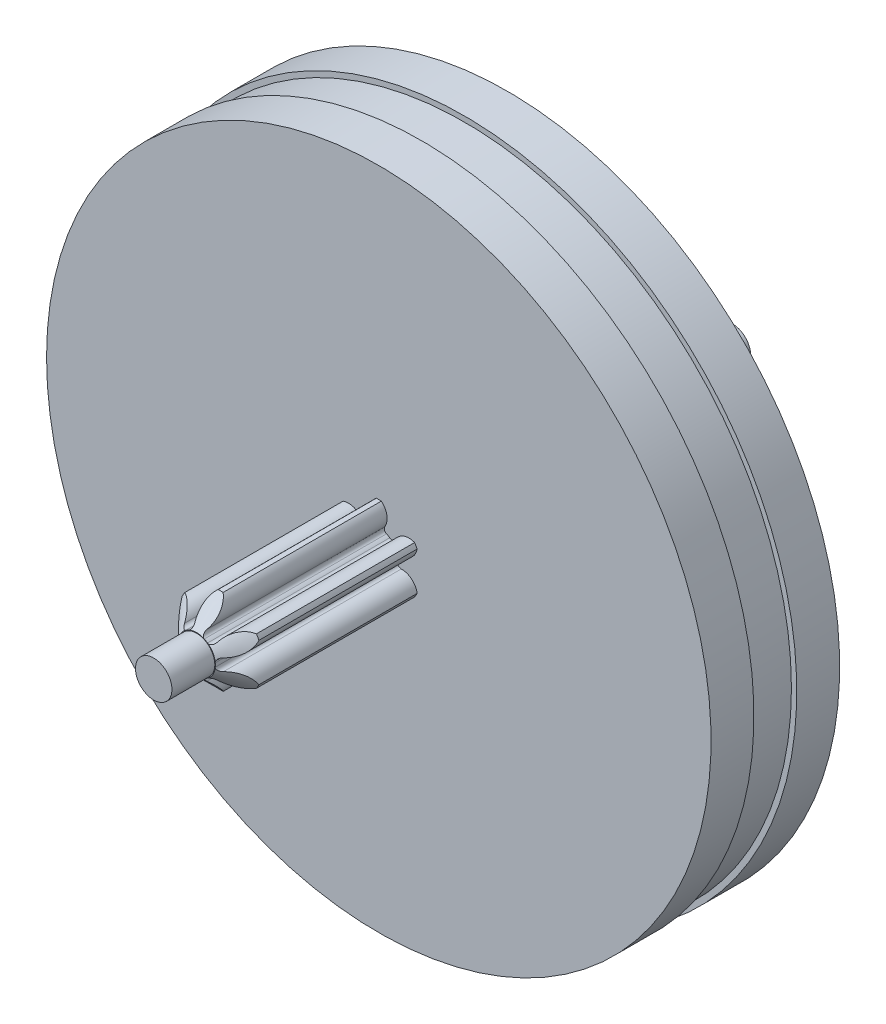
from build123d import *

# Parameters (mm, degrees)
BOSS_EXTRU_1_DEPTH                        = 8.5
CONG_1_R                                  = 0.175
CHANFREIN1_SIZE                           = 1.12
R_P_TITION_CIRCULAIRE4_COUNT              = 6
CONG_1_OF_R_P_TITION_CIRCULAIRE4_R        = 0.175
CHANFREIN1_OF_R_P_TITION_CIRCULAIRE4_SIZE = 1.12
ESQUISSE11_R                              = 15.5
EXTRUSION1_DEPTH                          = 2
ESQUISSE12_R                              = 15.25
EXTRUSION2_DEPTH                          = 2
ESQUISSE13_R                              = 15.5
EXTRUSION3_DEPTH                          = 2
ESQUISSE14_R                              = 1.9
EXTRUSION4_DEPTH                          = 8.5
ESQUISSE14_3_R                            = 0.85
EXTRUSION5_DEPTH                          = 10.5
EXTRUSION6_START                          = -16.5
ESQUISSE14_4_R                            = 0.85
EXTRUSION6_DEPTH                          = 16.5


with BuildPart() as part:
    # Esquisse3 → Boss.-Extru.1 (new body)
    with BuildSketch(Plane.XY):
        with BuildLine():
            Line((-1.816206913, 0.19741977), (-1.378706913, -0.560352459))
            Line((-1.378706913, -0.560352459), (-0.941206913, 0.19741977))
            ThreePointArc((-0.941206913, 0.19741977), (-1.091406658, 0.266136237), (-1.251843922, 0.305401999))
            ThreePointArc((-1.251843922, 0.305401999), (-0.990185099, 0.873004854), (-1.26121453, 1.436193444))
            ThreePointArc((-1.26121453, 1.436193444), (-1.378706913, 1.439647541), (-1.496199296, 1.436193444))
            ThreePointArc((-1.496199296, 1.436193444), (-1.767228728, 0.873004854), (-1.505569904, 0.305401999))
            ThreePointArc((-1.505569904, 0.305401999), (-1.666007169, 0.266136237), (-1.816206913, 0.19741977))
        make_face()
    boss_extru_1 = extrude(amount=BOSS_EXTRU_1_DEPTH)

    # Cong_1
    cong_1_edges = [part.edges().sort_by_distance(p)[0] for p in [
        (-1.505569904, 0.305401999, 4.25),
        (-1.251843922, 0.305401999, 4.25),
    ]]
    fillet(cong_1_edges, radius=CONG_1_R)

    # Chanfrein1
    chanfrein1_edges = [part.edges().sort_by_distance(p)[0] for p in [
        (-1.378706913, 1.439647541, 8.5),
    ]]
    chamfer(chanfrein1_edges, length=CHANFREIN1_SIZE)

    # R_p_tition circulaire4: Boss.-Extru.1 ×6 about axis
    r_p_tition_circulaire4_axis = Axis((-1.378706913, -0.560352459, 0), (0, 0, 1))
    for i in range(1, R_P_TITION_CIRCULAIRE4_COUNT):
        add(boss_extru_1.rotate(r_p_tition_circulaire4_axis, i * 360 / R_P_TITION_CIRCULAIRE4_COUNT))

    # Cong_1 of R_p_tition circulaire4
    cong_1_of_r_p_tition_circulaire4_edges = [part.edges().sort_by_distance(p)[0] for p in [
        (-2.191903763, -0.237341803, 4.25),
        (-2.065040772, -0.017608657, 4.25),
        (-2.065040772, -1.103096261, 4.25),
        (-2.191903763, -0.883363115, 4.25),
        (-1.251843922, -1.426106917, 4.25),
        (-1.505569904, -1.426106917, 4.25),
        (-0.565510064, -0.883363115, 4.25),
        (-0.692373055, -1.103096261, 4.25),
        (-0.692373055, -0.017608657, 4.25),
        (-0.565510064, -0.237341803, 4.25),
    ]]
    fillet(cong_1_of_r_p_tition_circulaire4_edges, radius=CONG_1_OF_R_P_TITION_CIRCULAIRE4_R)

    # Chanfrein1 of R_p_tition circulaire4
    chanfrein1_of_r_p_tition_circulaire4_edges = [part.edges().sort_by_distance(p)[0] for p in [
        (-3.110757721, 0.439647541, 8.5),
        (-3.110757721, -1.560352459, 8.5),
        (-1.378706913, -2.560352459, 8.5),
        (0.353343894, -1.560352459, 8.5),
        (0.353343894, 0.439647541, 8.5),
    ]]
    chamfer(chanfrein1_of_r_p_tition_circulaire4_edges, length=CHANFREIN1_OF_R_P_TITION_CIRCULAIRE4_SIZE)

    # Esquisse11 → Extrusion1 (add)
    with BuildSketch(Plane(origin=(0, 0, 0), x_dir=(-1, 0, 0), z_dir=(0, 0, -1))):
        with Locations((1.378706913, -0.560352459)):
            Circle(ESQUISSE11_R)
    extrude(amount=EXTRUSION1_DEPTH)

    # Esquisse12 → Extrusion2 (add)
    with BuildSketch(Plane(origin=(0, 0, -2), x_dir=(-1, 0, 0), z_dir=(0, 0, -1))):
        with Locations((1.378706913, -0.560352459)):
            Circle(ESQUISSE12_R)
    extrude(amount=EXTRUSION2_DEPTH)

    # Esquisse13 → Extrusion3 (add)
    with BuildSketch(Plane(origin=(0, 0, -4), x_dir=(-1, 0, 0), z_dir=(0, 0, -1))):
        with Locations((1.378706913, -0.560352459)):
            Circle(ESQUISSE13_R)
    extrude(amount=EXTRUSION3_DEPTH)

    # Esquisse14 → Extrusion4 (add)
    with BuildSketch(Plane(origin=(0, 0, -6), x_dir=(-1, 0, 0), z_dir=(0, 0, -1))):
        with Locations((1.378706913, -0.560352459)):
            Circle(ESQUISSE14_R)
    extrude(amount=EXTRUSION4_DEPTH)

    # Esquisse14_3 → Extrusion5 (add)
    with BuildSketch(Plane(origin=(0, 0, -6), x_dir=(-1, 0, 0), z_dir=(0, 0, -1))):
        with Locations(Location((1.378706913, -0.560352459, 0), (0, 0, 180))):
            Circle(ESQUISSE14_3_R)
    extrude(amount=EXTRUSION5_DEPTH)

    # Esquisse14_4 → Extrusion6 (add)
    with BuildSketch(Plane(origin=(0, 0, -6), x_dir=(-1, 0, 0), z_dir=(0, 0, -1)).offset(EXTRUSION6_START)):
        with Locations(Location((1.378706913, -0.560352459, 0), (0, 0, 180))):
            Circle(ESQUISSE14_4_R)
    extrude(amount=EXTRUSION6_DEPTH)


solid = part.part
